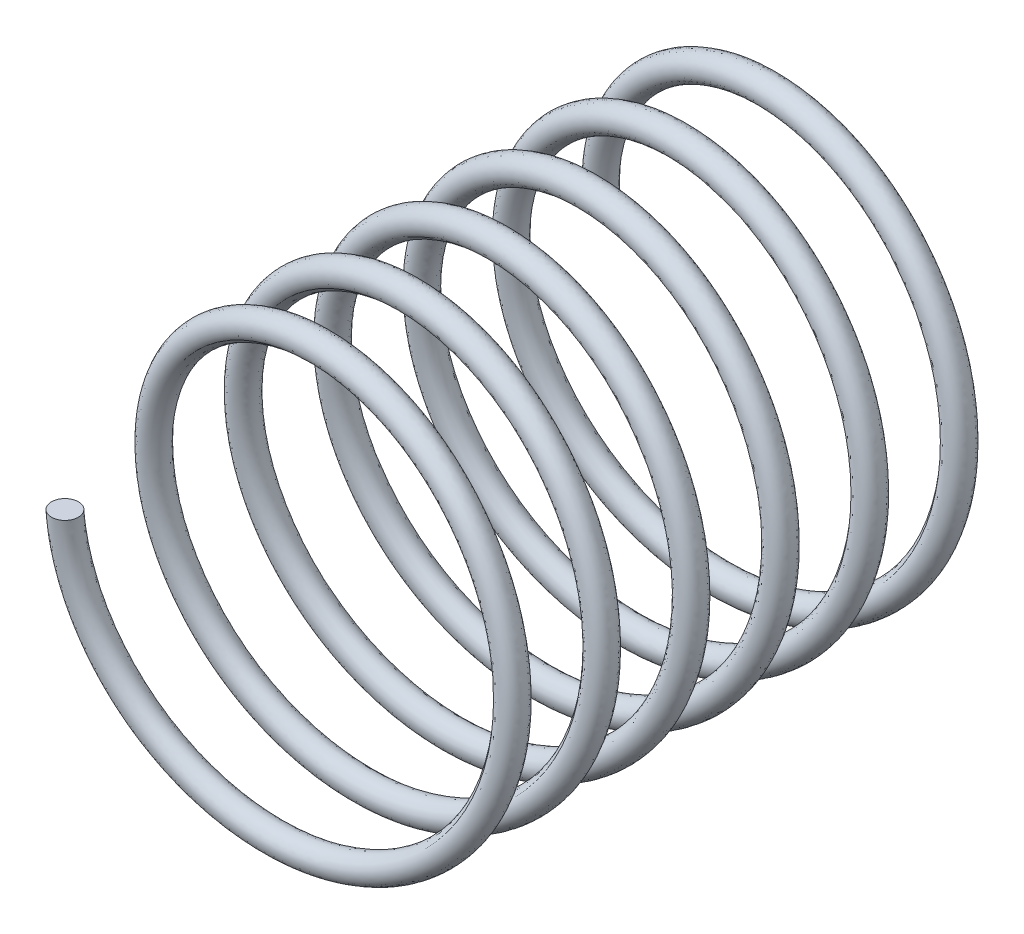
from build123d import *

# Parameters (mm, degrees)
SWEEP1_PITCH       = 2
SWEEP1_HEIGHT      = 12
SWEEP1_RADIUS      = 4.5
SWEEP1_START_ANGLE = -180
SKETCH2_R          = 0.3


with BuildPart() as part:
    # Sweep1: sweep along a helix
    with BuildLine() as sweep1_path:
        add(Helix(SWEEP1_PITCH, SWEEP1_HEIGHT, SWEEP1_RADIUS, center=(0, 0, 0), direction=(0, 0, 1), lefthand=True, mode=Mode.PRIVATE).rotate(Axis((0, 0, 0), (0, 0, 1)), SWEEP1_START_ANGLE))
    # Sketch2 → Sweep1 (sweep)
    with BuildSketch(Plane(origin=(0, 0, 0), x_dir=(1, 0, 0), z_dir=(0, 1, 0))):
        with Locations((-4.5, -12)):
            Circle(SKETCH2_R)
    sweep(path=sweep1_path.line, is_frenet=True)


solid = part.part
